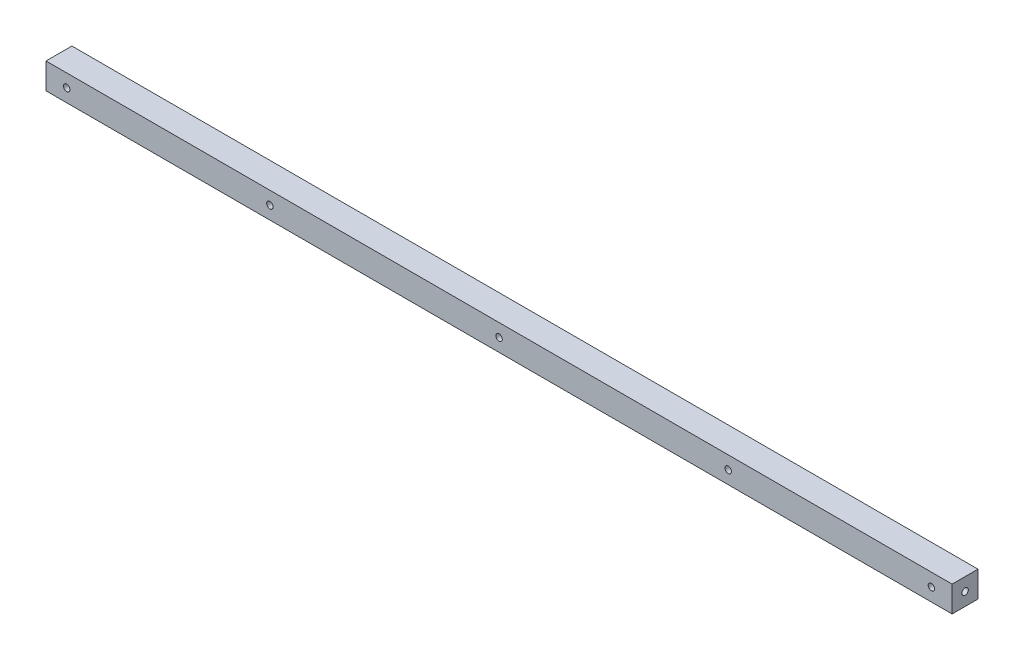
ISO-10303-21;
HEADER;
FILE_DESCRIPTION(('STEP AP214'),'2;1');
FILE_NAME('part.step','',(''),(''),'','','');
FILE_SCHEMA(('AUTOMOTIVE_DESIGN { 1 0 10303 214 1 1 1 1 }'));
ENDSEC;
DATA;
#1=APPLICATION_CONTEXT('core data for automotive mechanical design processes');
#2=APPLICATION_PROTOCOL_DEFINITION('international standard','automotive_design',2000,#1);
#3=PRODUCT_CONTEXT('',#1,'mechanical');
#4=PRODUCT('Part','Part','',(#3));
#5=PRODUCT_RELATED_PRODUCT_CATEGORY('part','',(#4));
#6=PRODUCT_DEFINITION_FORMATION('','',#4);
#7=PRODUCT_DEFINITION_CONTEXT('part definition',#1,'design');
#8=PRODUCT_DEFINITION('design','',#6,#7);
#9=PRODUCT_DEFINITION_SHAPE('','',#8);
#10=(LENGTH_UNIT() NAMED_UNIT(*) SI_UNIT(.MILLI.,.METRE.));
#11=(NAMED_UNIT(*) PLANE_ANGLE_UNIT() SI_UNIT($,.RADIAN.));
#12=(NAMED_UNIT(*) SI_UNIT($,.STERADIAN.) SOLID_ANGLE_UNIT());
#13=UNCERTAINTY_MEASURE_WITH_UNIT(LENGTH_MEASURE(1.E-05),#10,'distance_accuracy_value','');
#14=(GEOMETRIC_REPRESENTATION_CONTEXT(3) GLOBAL_UNCERTAINTY_ASSIGNED_CONTEXT((#13)) GLOBAL_UNIT_ASSIGNED_CONTEXT((#10,
#11,#12)) REPRESENTATION_CONTEXT('',''));
#15=CARTESIAN_POINT('',(0.,0.,0.));
#16=DIRECTION('',(0.,0.,1.));
#17=DIRECTION('',(1.,0.,0.));
#18=AXIS2_PLACEMENT_3D('',#15,#16,#17);
#19=CARTESIAN_POINT('',(334.,0.,10.));
#20=DIRECTION('',(0.,0.,1.));
#21=DIRECTION('',(1.,0.,0.));
#22=AXIS2_PLACEMENT_3D('',#19,#20,#21);
#23=CYLINDRICAL_SURFACE('',#22,2.5);
#24=CARTESIAN_POINT('',(334.,0.,10.));
#25=DIRECTION('',(0.,0.,1.));
#26=DIRECTION('',(1.,0.,0.));
#27=AXIS2_PLACEMENT_3D('',#24,#25,#26);
#28=CIRCLE('',#27,2.5);
#29=CARTESIAN_POINT('',(336.5,0.,10.));
#30=VERTEX_POINT('',#29);
#31=EDGE_CURVE('E158',#30,#30,#28,.T.);
#32=ORIENTED_EDGE('',*,*,#31,.T.);
#33=EDGE_LOOP('',(#32));
#34=FACE_BOUND('',#33,.T.);
#35=CARTESIAN_POINT('',(334.,0.,0.));
#36=DIRECTION('',(-0.707106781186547,0.,0.707106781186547));
#37=DIRECTION('',(0.707106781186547,0.,0.707106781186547));
#38=AXIS2_PLACEMENT_3D('',#35,#36,#37);
#39=ELLIPSE('',#38,3.53553390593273,2.5);
#40=CARTESIAN_POINT('',(334.,2.49999999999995,0.));
#41=VERTEX_POINT('',#40);
#42=CARTESIAN_POINT('',(334.,-2.49999999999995,0.));
#43=VERTEX_POINT('',#42);
#44=EDGE_CURVE('E52',#41,#43,#39,.F.);
#45=ORIENTED_EDGE('',*,*,#44,.T.);
#46=CARTESIAN_POINT('',(334.,0.,0.));
#47=DIRECTION('',(0.707106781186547,0.,0.707106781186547));
#48=DIRECTION('',(-0.707106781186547,0.,0.707106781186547));
#49=AXIS2_PLACEMENT_3D('',#46,#47,#48);
#50=ELLIPSE('',#49,3.53553390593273,2.5);
#51=EDGE_CURVE('E11',#43,#41,#50,.F.);
#52=ORIENTED_EDGE('',*,*,#51,.T.);
#53=EDGE_LOOP('',(#45,#52));
#54=FACE_BOUND('',#53,.T.);
#55=ADVANCED_FACE('F38',(#34,#54),#23,.F.);
#56=CARTESIAN_POINT('',(-334.,0.,10.));
#57=DIRECTION('',(0.,0.,1.));
#58=DIRECTION('',(1.,0.,0.));
#59=AXIS2_PLACEMENT_3D('',#56,#57,#58);
#60=CYLINDRICAL_SURFACE('',#59,2.5);
#61=CARTESIAN_POINT('',(-334.,0.,10.));
#62=DIRECTION('',(0.,0.,1.));
#63=DIRECTION('',(1.,0.,0.));
#64=AXIS2_PLACEMENT_3D('',#61,#62,#63);
#65=CIRCLE('',#64,2.5);
#66=CARTESIAN_POINT('',(-331.5,0.,10.));
#67=VERTEX_POINT('',#66);
#68=EDGE_CURVE('E127',#67,#67,#65,.T.);
#69=ORIENTED_EDGE('',*,*,#68,.T.);
#70=EDGE_LOOP('',(#69));
#71=FACE_BOUND('',#70,.T.);
#72=CARTESIAN_POINT('',(-334.,0.,0.));
#73=DIRECTION('',(0.707106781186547,0.,0.707106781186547));
#74=DIRECTION('',(-0.707106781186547,0.,0.707106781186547));
#75=AXIS2_PLACEMENT_3D('',#72,#73,#74);
#76=ELLIPSE('',#75,3.53553390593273,2.5);
#77=CARTESIAN_POINT('',(-334.,-2.49999999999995,0.));
#78=VERTEX_POINT('',#77);
#79=CARTESIAN_POINT('',(-334.,2.49999999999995,0.));
#80=VERTEX_POINT('',#79);
#81=EDGE_CURVE('E59',#78,#80,#76,.F.);
#82=ORIENTED_EDGE('',*,*,#81,.T.);
#83=CARTESIAN_POINT('',(-334.,0.,0.));
#84=DIRECTION('',(-0.707106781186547,0.,0.707106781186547));
#85=DIRECTION('',(0.707106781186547,0.,0.707106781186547));
#86=AXIS2_PLACEMENT_3D('',#83,#84,#85);
#87=ELLIPSE('',#86,3.53553390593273,2.5);
#88=EDGE_CURVE('E213',#80,#78,#87,.F.);
#89=ORIENTED_EDGE('',*,*,#88,.T.);
#90=EDGE_LOOP('',(#82,#89));
#91=FACE_BOUND('',#90,.T.);
#92=ADVANCED_FACE('F231',(#71,#91),#60,.F.);
#93=CARTESIAN_POINT('',(350.,-10.0000000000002,10.));
#94=DIRECTION('',(0.,0.,-1.));
#95=DIRECTION('',(-1.,0.,0.));
#96=AXIS2_PLACEMENT_3D('',#93,#94,#95);
#97=PLANE('',#96);
#98=ORIENTED_EDGE('',*,*,#68,.F.);
#99=EDGE_LOOP('',(#98));
#100=FACE_BOUND('',#99,.T.);
#101=CARTESIAN_POINT('',(-177.,0.,9.99999999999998));
#102=DIRECTION('',(0.,0.,1.));
#103=DIRECTION('',(1.,0.,0.));
#104=AXIS2_PLACEMENT_3D('',#101,#102,#103);
#105=CIRCLE('',#104,2.49999999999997);
#106=CARTESIAN_POINT('',(-174.5,0.,9.99999999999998));
#107=VERTEX_POINT('',#106);
#108=EDGE_CURVE('E135',#107,#107,#105,.T.);
#109=ORIENTED_EDGE('',*,*,#108,.F.);
#110=EDGE_LOOP('',(#109));
#111=FACE_BOUND('',#110,.T.);
#112=CARTESIAN_POINT('',(0.,0.,10.));
#113=DIRECTION('',(0.,0.,1.));
#114=DIRECTION('',(1.,0.,0.));
#115=AXIS2_PLACEMENT_3D('',#112,#113,#114);
#116=CIRCLE('',#115,2.49999999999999);
#117=CARTESIAN_POINT('',(2.50000000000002,0.,10.));
#118=VERTEX_POINT('',#117);
#119=EDGE_CURVE('E142',#118,#118,#116,.T.);
#120=ORIENTED_EDGE('',*,*,#119,.F.);
#121=EDGE_LOOP('',(#120));
#122=FACE_BOUND('',#121,.T.);
#123=CARTESIAN_POINT('',(177.,0.,10.));
#124=DIRECTION('',(0.,0.,1.));
#125=DIRECTION('',(1.,0.,0.));
#126=AXIS2_PLACEMENT_3D('',#123,#124,#125);
#127=CIRCLE('',#126,2.49999999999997);
#128=CARTESIAN_POINT('',(179.5,0.,10.));
#129=VERTEX_POINT('',#128);
#130=EDGE_CURVE('E150',#129,#129,#127,.T.);
#131=ORIENTED_EDGE('',*,*,#130,.F.);
#132=EDGE_LOOP('',(#131));
#133=FACE_BOUND('',#132,.T.);
#134=ORIENTED_EDGE('',*,*,#31,.F.);
#135=EDGE_LOOP('',(#134));
#136=FACE_BOUND('',#135,.T.);
#137=DIRECTION('',(0.,-1.,0.));
#138=VECTOR('',#137,1.);
#139=CARTESIAN_POINT('',(-350.,-9.99999999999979,10.));
#140=LINE('',#139,#138);
#141=CARTESIAN_POINT('',(-350.,10.0000000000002,10.));
#142=VERTEX_POINT('',#141);
#143=CARTESIAN_POINT('',(-350.,-9.99999999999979,10.));
#144=VERTEX_POINT('',#143);
#145=EDGE_CURVE('E162',#142,#144,#140,.T.);
#146=ORIENTED_EDGE('',*,*,#145,.T.);
#147=DIRECTION('',(-1.,0.,0.));
#148=VECTOR('',#147,1.);
#149=CARTESIAN_POINT('',(350.,-10.0000000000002,10.));
#150=LINE('',#149,#148);
#151=CARTESIAN_POINT('',(350.,-10.0000000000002,10.));
#152=VERTEX_POINT('',#151);
#153=EDGE_CURVE('E199',#152,#144,#150,.T.);
#154=ORIENTED_EDGE('',*,*,#153,.F.);
#155=DIRECTION('',(0.,-1.,0.));
#156=VECTOR('',#155,1.);
#157=CARTESIAN_POINT('',(350.,-10.0000000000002,10.));
#158=LINE('',#157,#156);
#159=CARTESIAN_POINT('',(350.,9.99999999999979,10.));
#160=VERTEX_POINT('',#159);
#161=EDGE_CURVE('E174',#160,#152,#158,.T.);
#162=ORIENTED_EDGE('',*,*,#161,.F.);
#163=DIRECTION('',(-1.,0.,0.));
#164=VECTOR('',#163,1.);
#165=CARTESIAN_POINT('',(350.,9.99999999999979,10.));
#166=LINE('',#165,#164);
#167=EDGE_CURVE('E187',#160,#142,#166,.T.);
#168=ORIENTED_EDGE('',*,*,#167,.T.);
#169=EDGE_LOOP('',(#146,#154,#162,#168));
#170=FACE_BOUND('',#169,.T.);
#171=ADVANCED_FACE('F40',(#100,#111,#122,#133,#136,#170),#97,.F.);
#172=CARTESIAN_POINT('',(350.,-10.0000000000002,10.));
#173=DIRECTION('',(0.,1.,0.));
#174=DIRECTION('',(0.,0.,1.));
#175=AXIS2_PLACEMENT_3D('',#172,#173,#174);
#176=PLANE('',#175);
#177=DIRECTION('',(0.,0.,-1.));
#178=VECTOR('',#177,1.);
#179=CARTESIAN_POINT('',(-350.,-9.99999999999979,10.));
#180=LINE('',#179,#178);
#181=CARTESIAN_POINT('',(-350.,-9.99999999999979,-10.));
#182=VERTEX_POINT('',#181);
#183=EDGE_CURVE('E166',#144,#182,#180,.T.);
#184=ORIENTED_EDGE('',*,*,#183,.T.);
#185=DIRECTION('',(-1.,0.,0.));
#186=VECTOR('',#185,1.);
#187=CARTESIAN_POINT('',(350.,-10.0000000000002,-10.));
#188=LINE('',#187,#186);
#189=CARTESIAN_POINT('',(350.,-10.0000000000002,-10.));
#190=VERTEX_POINT('',#189);
#191=EDGE_CURVE('E195',#190,#182,#188,.T.);
#192=ORIENTED_EDGE('',*,*,#191,.F.);
#193=DIRECTION('',(0.,0.,-1.));
#194=VECTOR('',#193,1.);
#195=CARTESIAN_POINT('',(350.,-10.0000000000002,10.));
#196=LINE('',#195,#194);
#197=EDGE_CURVE('E178',#152,#190,#196,.T.);
#198=ORIENTED_EDGE('',*,*,#197,.F.);
#199=ORIENTED_EDGE('',*,*,#153,.T.);
#200=EDGE_LOOP('',(#184,#192,#198,#199));
#201=FACE_BOUND('',#200,.T.);
#202=ADVANCED_FACE('F267',(#201),#176,.F.);
#203=CARTESIAN_POINT('',(350.,-10.0000000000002,-10.));
#204=DIRECTION('',(0.,0.,1.));
#205=DIRECTION('',(1.,0.,0.));
#206=AXIS2_PLACEMENT_3D('',#203,#204,#205);
#207=PLANE('',#206);
#208=CARTESIAN_POINT('',(-334.,0.,-10.));
#209=DIRECTION('',(0.,0.,1.));
#210=DIRECTION('',(1.,0.,0.));
#211=AXIS2_PLACEMENT_3D('',#208,#209,#210);
#212=CIRCLE('',#211,2.5);
#213=CARTESIAN_POINT('',(-331.5,0.,-10.));
#214=VERTEX_POINT('',#213);
#215=EDGE_CURVE('E123',#214,#214,#212,.T.);
#216=ORIENTED_EDGE('',*,*,#215,.T.);
#217=EDGE_LOOP('',(#216));
#218=FACE_BOUND('',#217,.T.);
#219=CARTESIAN_POINT('',(-177.,0.,-10.));
#220=DIRECTION('',(0.,0.,1.));
#221=DIRECTION('',(1.,0.,0.));
#222=AXIS2_PLACEMENT_3D('',#219,#220,#221);
#223=CIRCLE('',#222,2.5);
#224=CARTESIAN_POINT('',(-174.5,0.,-10.));
#225=VERTEX_POINT('',#224);
#226=EDGE_CURVE('E131',#225,#225,#223,.T.);
#227=ORIENTED_EDGE('',*,*,#226,.T.);
#228=EDGE_LOOP('',(#227));
#229=FACE_BOUND('',#228,.T.);
#230=CARTESIAN_POINT('',(0.,0.,-10.));
#231=DIRECTION('',(0.,0.,1.));
#232=DIRECTION('',(1.,0.,0.));
#233=AXIS2_PLACEMENT_3D('',#230,#231,#232);
#234=CIRCLE('',#233,2.5);
#235=CARTESIAN_POINT('',(2.50000000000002,0.,-10.));
#236=VERTEX_POINT('',#235);
#237=EDGE_CURVE('E139',#236,#236,#234,.T.);
#238=ORIENTED_EDGE('',*,*,#237,.T.);
#239=EDGE_LOOP('',(#238));
#240=FACE_BOUND('',#239,.T.);
#241=CARTESIAN_POINT('',(177.,0.,-9.99999999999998));
#242=DIRECTION('',(0.,0.,1.));
#243=DIRECTION('',(1.,0.,0.));
#244=AXIS2_PLACEMENT_3D('',#241,#242,#243);
#245=CIRCLE('',#244,2.5);
#246=CARTESIAN_POINT('',(179.5,0.,-9.99999999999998));
#247=VERTEX_POINT('',#246);
#248=EDGE_CURVE('E146',#247,#247,#245,.T.);
#249=ORIENTED_EDGE('',*,*,#248,.T.);
#250=EDGE_LOOP('',(#249));
#251=FACE_BOUND('',#250,.T.);
#252=CARTESIAN_POINT('',(334.,0.,-10.));
#253=DIRECTION('',(0.,0.,1.));
#254=DIRECTION('',(1.,0.,0.));
#255=AXIS2_PLACEMENT_3D('',#252,#253,#254);
#256=CIRCLE('',#255,2.5);
#257=CARTESIAN_POINT('',(336.5,0.,-10.));
#258=VERTEX_POINT('',#257);
#259=EDGE_CURVE('E154',#258,#258,#256,.T.);
#260=ORIENTED_EDGE('',*,*,#259,.T.);
#261=EDGE_LOOP('',(#260));
#262=FACE_BOUND('',#261,.T.);
#263=DIRECTION('',(0.,1.,0.));
#264=VECTOR('',#263,1.);
#265=CARTESIAN_POINT('',(-350.,-9.99999999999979,-10.));
#266=LINE('',#265,#264);
#267=CARTESIAN_POINT('',(-350.,10.0000000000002,-10.));
#268=VERTEX_POINT('',#267);
#269=EDGE_CURVE('E169',#182,#268,#266,.T.);
#270=ORIENTED_EDGE('',*,*,#269,.T.);
#271=DIRECTION('',(-1.,0.,0.));
#272=VECTOR('',#271,1.);
#273=CARTESIAN_POINT('',(350.,9.99999999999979,-10.));
#274=LINE('',#273,#272);
#275=CARTESIAN_POINT('',(350.,9.99999999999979,-10.));
#276=VERTEX_POINT('',#275);
#277=EDGE_CURVE('E191',#276,#268,#274,.T.);
#278=ORIENTED_EDGE('',*,*,#277,.F.);
#279=DIRECTION('',(0.,1.,0.));
#280=VECTOR('',#279,1.);
#281=CARTESIAN_POINT('',(350.,-10.0000000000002,-10.));
#282=LINE('',#281,#280);
#283=EDGE_CURVE('E181',#190,#276,#282,.T.);
#284=ORIENTED_EDGE('',*,*,#283,.F.);
#285=ORIENTED_EDGE('',*,*,#191,.T.);
#286=EDGE_LOOP('',(#270,#278,#284,#285));
#287=FACE_BOUND('',#286,.T.);
#288=ADVANCED_FACE('F264',(#218,#229,#240,#251,#262,#287),#207,.F.);
#289=CARTESIAN_POINT('',(350.,9.99999999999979,10.));
#290=DIRECTION('',(0.,-1.,0.));
#291=DIRECTION('',(0.,0.,-1.));
#292=AXIS2_PLACEMENT_3D('',#289,#290,#291);
#293=PLANE('',#292);
#294=DIRECTION('',(0.,0.,1.));
#295=VECTOR('',#294,1.);
#296=CARTESIAN_POINT('',(-350.,10.0000000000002,10.));
#297=LINE('',#296,#295);
#298=EDGE_CURVE('E171',#268,#142,#297,.T.);
#299=ORIENTED_EDGE('',*,*,#298,.T.);
#300=ORIENTED_EDGE('',*,*,#167,.F.);
#301=DIRECTION('',(0.,0.,1.));
#302=VECTOR('',#301,1.);
#303=CARTESIAN_POINT('',(350.,9.99999999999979,10.));
#304=LINE('',#303,#302);
#305=EDGE_CURVE('E184',#276,#160,#304,.T.);
#306=ORIENTED_EDGE('',*,*,#305,.F.);
#307=ORIENTED_EDGE('',*,*,#277,.T.);
#308=EDGE_LOOP('',(#299,#300,#306,#307));
#309=FACE_BOUND('',#308,.T.);
#310=ADVANCED_FACE('F256',(#309),#293,.F.);
#311=CARTESIAN_POINT('',(350.,9.99999999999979,10.));
#312=DIRECTION('',(-1.,0.,0.));
#313=DIRECTION('',(0.,0.,1.));
#314=AXIS2_PLACEMENT_3D('',#311,#312,#313);
#315=PLANE('',#314);
#316=CARTESIAN_POINT('',(350.,0.,0.));
#317=DIRECTION('',(1.,0.,0.));
#318=DIRECTION('',(0.,0.,-1.));
#319=AXIS2_PLACEMENT_3D('',#316,#317,#318);
#320=CIRCLE('',#319,2.49999999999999);
#321=CARTESIAN_POINT('',(350.,0.,-2.49999999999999));
#322=VERTEX_POINT('',#321);
#323=EDGE_CURVE('E107',#322,#322,#320,.T.);
#324=ORIENTED_EDGE('',*,*,#323,.F.);
#325=EDGE_LOOP('',(#324));
#326=FACE_BOUND('',#325,.T.);
#327=ORIENTED_EDGE('',*,*,#161,.T.);
#328=ORIENTED_EDGE('',*,*,#197,.T.);
#329=ORIENTED_EDGE('',*,*,#283,.T.);
#330=ORIENTED_EDGE('',*,*,#305,.T.);
#331=EDGE_LOOP('',(#327,#328,#329,#330));
#332=FACE_BOUND('',#331,.T.);
#333=ADVANCED_FACE('F251',(#326,#332),#315,.F.);
#334=CARTESIAN_POINT('',(-350.,10.0000000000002,10.));
#335=DIRECTION('',(-1.,0.,0.));
#336=DIRECTION('',(0.,0.,1.));
#337=AXIS2_PLACEMENT_3D('',#334,#335,#336);
#338=PLANE('',#337);
#339=CARTESIAN_POINT('',(-350.,0.,0.));
#340=DIRECTION('',(-1.,0.,0.));
#341=DIRECTION('',(0.,0.,1.));
#342=AXIS2_PLACEMENT_3D('',#339,#340,#341);
#343=CIRCLE('',#342,2.49999999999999);
#344=CARTESIAN_POINT('',(-350.,0.,2.49999999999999));
#345=VERTEX_POINT('',#344);
#346=EDGE_CURVE('E119',#345,#345,#343,.T.);
#347=ORIENTED_EDGE('',*,*,#346,.F.);
#348=EDGE_LOOP('',(#347));
#349=FACE_BOUND('',#348,.T.);
#350=ORIENTED_EDGE('',*,*,#145,.F.);
#351=ORIENTED_EDGE('',*,*,#298,.F.);
#352=ORIENTED_EDGE('',*,*,#269,.F.);
#353=ORIENTED_EDGE('',*,*,#183,.F.);
#354=EDGE_LOOP('',(#350,#351,#352,#353));
#355=FACE_BOUND('',#354,.T.);
#356=ADVANCED_FACE('F244',(#349,#355),#338,.T.);
#357=CARTESIAN_POINT('',(334.,0.,0.));
#358=DIRECTION('',(-0.707106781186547,0.,0.707106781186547));
#359=DIRECTION('',(0.707106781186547,0.,0.707106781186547));
#360=AXIS2_PLACEMENT_3D('',#357,#358,#359);
#361=ELLIPSE('',#360,3.53553390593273,2.5);
#362=EDGE_CURVE('E218',#41,#43,#361,.T.);
#363=ORIENTED_EDGE('',*,*,#362,.T.);
#364=CARTESIAN_POINT('',(334.,0.,0.));
#365=DIRECTION('',(0.707106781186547,0.,0.707106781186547));
#366=DIRECTION('',(-0.707106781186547,0.,0.707106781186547));
#367=AXIS2_PLACEMENT_3D('',#364,#365,#366);
#368=ELLIPSE('',#367,3.53553390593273,2.5);
#369=EDGE_CURVE('E47',#43,#41,#368,.T.);
#370=ORIENTED_EDGE('',*,*,#369,.T.);
#371=EDGE_LOOP('',(#363,#370));
#372=FACE_BOUND('',#371,.T.);
#373=ORIENTED_EDGE('',*,*,#259,.F.);
#374=EDGE_LOOP('',(#373));
#375=FACE_BOUND('',#374,.T.);
#376=ADVANCED_FACE('F224',(#372,#375),#23,.F.);
#377=CARTESIAN_POINT('',(177.,0.,10.));
#378=DIRECTION('',(0.,0.,1.));
#379=DIRECTION('',(1.,0.,0.));
#380=AXIS2_PLACEMENT_3D('',#377,#378,#379);
#381=CYLINDRICAL_SURFACE('',#380,2.49999999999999);
#382=ORIENTED_EDGE('',*,*,#248,.F.);
#383=EDGE_LOOP('',(#382));
#384=FACE_BOUND('',#383,.T.);
#385=ORIENTED_EDGE('',*,*,#130,.T.);
#386=EDGE_LOOP('',(#385));
#387=FACE_BOUND('',#386,.T.);
#388=ADVANCED_FACE('F243',(#384,#387),#381,.F.);
#389=CARTESIAN_POINT('',(0.,0.,10.));
#390=DIRECTION('',(0.,0.,1.));
#391=DIRECTION('',(1.,0.,0.));
#392=AXIS2_PLACEMENT_3D('',#389,#390,#391);
#393=CYLINDRICAL_SURFACE('',#392,2.49999999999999);
#394=ORIENTED_EDGE('',*,*,#237,.F.);
#395=EDGE_LOOP('',(#394));
#396=FACE_BOUND('',#395,.T.);
#397=ORIENTED_EDGE('',*,*,#119,.T.);
#398=EDGE_LOOP('',(#397));
#399=FACE_BOUND('',#398,.T.);
#400=ADVANCED_FACE('F249',(#396,#399),#393,.F.);
#401=CARTESIAN_POINT('',(-177.,0.,9.99999999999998));
#402=DIRECTION('',(0.,0.,1.));
#403=DIRECTION('',(1.,0.,0.));
#404=AXIS2_PLACEMENT_3D('',#401,#402,#403);
#405=CYLINDRICAL_SURFACE('',#404,2.49999999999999);
#406=ORIENTED_EDGE('',*,*,#226,.F.);
#407=EDGE_LOOP('',(#406));
#408=FACE_BOUND('',#407,.T.);
#409=ORIENTED_EDGE('',*,*,#108,.T.);
#410=EDGE_LOOP('',(#409));
#411=FACE_BOUND('',#410,.T.);
#412=ADVANCED_FACE('F302',(#408,#411),#405,.F.);
#413=CARTESIAN_POINT('',(-334.,0.,0.));
#414=DIRECTION('',(0.707106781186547,0.,0.707106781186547));
#415=DIRECTION('',(-0.707106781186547,0.,0.707106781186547));
#416=AXIS2_PLACEMENT_3D('',#413,#414,#415);
#417=ELLIPSE('',#416,3.53553390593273,2.5);
#418=EDGE_CURVE('E205',#78,#80,#417,.T.);
#419=ORIENTED_EDGE('',*,*,#418,.T.);
#420=CARTESIAN_POINT('',(-334.,0.,0.));
#421=DIRECTION('',(-0.707106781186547,0.,0.707106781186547));
#422=DIRECTION('',(0.707106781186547,0.,0.707106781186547));
#423=AXIS2_PLACEMENT_3D('',#420,#421,#422);
#424=ELLIPSE('',#423,3.53553390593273,2.5);
#425=EDGE_CURVE('E209',#80,#78,#424,.T.);
#426=ORIENTED_EDGE('',*,*,#425,.T.);
#427=EDGE_LOOP('',(#419,#426));
#428=FACE_BOUND('',#427,.T.);
#429=ORIENTED_EDGE('',*,*,#215,.F.);
#430=EDGE_LOOP('',(#429));
#431=FACE_BOUND('',#430,.T.);
#432=ADVANCED_FACE('F239',(#428,#431),#60,.F.);
#433=CARTESIAN_POINT('',(-350.,0.,0.));
#434=DIRECTION('',(-1.,0.,0.));
#435=DIRECTION('',(0.,0.,1.));
#436=AXIS2_PLACEMENT_3D('',#433,#434,#435);
#437=CYLINDRICAL_SURFACE('',#436,2.49999999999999);
#438=ORIENTED_EDGE('',*,*,#346,.T.);
#439=EDGE_LOOP('',(#438));
#440=FACE_BOUND('',#439,.T.);
#441=ORIENTED_EDGE('',*,*,#81,.F.);
#442=ORIENTED_EDGE('',*,*,#425,.F.);
#443=EDGE_LOOP('',(#441,#442));
#444=FACE_BOUND('',#443,.T.);
#445=ADVANCED_FACE('F313',(#440,#444),#437,.F.);
#446=CARTESIAN_POINT('',(-330.,0.,0.));
#447=DIRECTION('',(-1.,0.,0.));
#448=DIRECTION('',(0.,0.,1.));
#449=AXIS2_PLACEMENT_3D('',#446,#447,#448);
#450=CIRCLE('',#449,2.5);
#451=CARTESIAN_POINT('',(-330.,0.,2.5));
#452=VERTEX_POINT('',#451);
#453=EDGE_CURVE('E113',#452,#452,#450,.T.);
#454=ORIENTED_EDGE('',*,*,#453,.F.);
#455=EDGE_LOOP('',(#454));
#456=FACE_BOUND('',#455,.T.);
#457=ORIENTED_EDGE('',*,*,#418,.F.);
#458=ORIENTED_EDGE('',*,*,#88,.F.);
#459=EDGE_LOOP('',(#457,#458));
#460=FACE_BOUND('',#459,.T.);
#461=ADVANCED_FACE('F315',(#456,#460),#437,.F.);
#462=CARTESIAN_POINT('',(-330.,0.,0.));
#463=DIRECTION('',(-1.,0.,0.));
#464=DIRECTION('',(0.,0.,1.));
#465=AXIS2_PLACEMENT_3D('',#462,#463,#464);
#466=CONICAL_SURFACE('',#465,2.5,1.02974425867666);
#467=CARTESIAN_POINT('',(-328.497848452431,0.,0.));
#468=VERTEX_POINT('',#467);
#469=VERTEX_LOOP('',#468);
#470=FACE_BOUND('',#469,.T.);
#471=ORIENTED_EDGE('',*,*,#453,.T.);
#472=EDGE_LOOP('',(#471));
#473=FACE_BOUND('',#472,.T.);
#474=ADVANCED_FACE('F318',(#470,#473),#466,.F.);
#475=CARTESIAN_POINT('',(350.,0.,0.));
#476=DIRECTION('',(1.,0.,0.));
#477=DIRECTION('',(0.,0.,-1.));
#478=AXIS2_PLACEMENT_3D('',#475,#476,#477);
#479=CYLINDRICAL_SURFACE('',#478,2.49999999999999);
#480=ORIENTED_EDGE('',*,*,#323,.T.);
#481=EDGE_LOOP('',(#480));
#482=FACE_BOUND('',#481,.T.);
#483=ORIENTED_EDGE('',*,*,#44,.F.);
#484=ORIENTED_EDGE('',*,*,#369,.F.);
#485=EDGE_LOOP('',(#483,#484));
#486=FACE_BOUND('',#485,.T.);
#487=ADVANCED_FACE('F228',(#482,#486),#479,.F.);
#488=CARTESIAN_POINT('',(330.,0.,0.));
#489=DIRECTION('',(1.,0.,0.));
#490=DIRECTION('',(0.,0.,-1.));
#491=AXIS2_PLACEMENT_3D('',#488,#489,#490);
#492=CIRCLE('',#491,2.49999999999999);
#493=CARTESIAN_POINT('',(330.,0.,-2.49999999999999));
#494=VERTEX_POINT('',#493);
#495=EDGE_CURVE('E104',#494,#494,#492,.T.);
#496=ORIENTED_EDGE('',*,*,#495,.F.);
#497=EDGE_LOOP('',(#496));
#498=FACE_BOUND('',#497,.T.);
#499=ORIENTED_EDGE('',*,*,#362,.F.);
#500=ORIENTED_EDGE('',*,*,#51,.F.);
#501=EDGE_LOOP('',(#499,#500));
#502=FACE_BOUND('',#501,.T.);
#503=ADVANCED_FACE('F100',(#498,#502),#479,.F.);
#504=CARTESIAN_POINT('',(330.,0.,0.));
#505=DIRECTION('',(1.,0.,0.));
#506=DIRECTION('',(0.,0.,-1.));
#507=AXIS2_PLACEMENT_3D('',#504,#505,#506);
#508=CONICAL_SURFACE('',#507,2.49999999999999,1.02974425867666);
#509=CARTESIAN_POINT('',(328.497848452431,0.,0.));
#510=VERTEX_POINT('',#509);
#511=VERTEX_LOOP('',#510);
#512=FACE_BOUND('',#511,.T.);
#513=ORIENTED_EDGE('',*,*,#495,.T.);
#514=EDGE_LOOP('',(#513));
#515=FACE_BOUND('',#514,.T.);
#516=ADVANCED_FACE('F97',(#512,#515),#508,.F.);
#517=CLOSED_SHELL('',(#55,#92,#171,#202,#288,#310,#333,#356,#376,#388,#400,#412,#432,#445,#461,
#474,#487,#503,#516));
#518=MANIFOLD_SOLID_BREP('B2',#517);
#519=ADVANCED_BREP_SHAPE_REPRESENTATION('',(#18,#518),#14);
#520=SHAPE_DEFINITION_REPRESENTATION(#9,#519);
ENDSEC;
END-ISO-10303-21;
